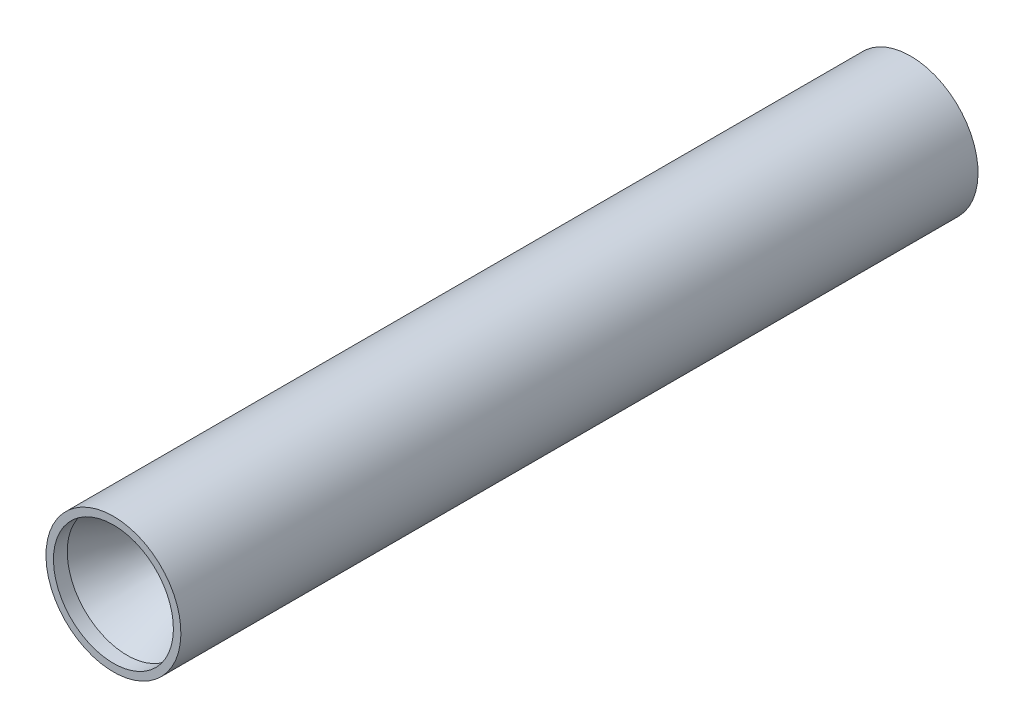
from build123d import *


with BuildPart() as part:
    # Sketch1 → Revolve1 (revolve)
    with BuildSketch(Plane(origin=(0, 0, 0), x_dir=(0, 0, -1), z_dir=(1, 0, 0))):
        Polygon((-289.5, 49), (289.5, 49), (289.5, 10), (279.5, 10), (279.5, 0), (264.5, 0), (264.5, 35.25), (-169.5, 35.25), (-169.5, 39), (-179.5, 39), (-204.5, 14), (-219.5, 15.576563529), (-279.5, 43.555023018), (-289.5, 43.555023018), align=None)
    revolve(axis=Axis((0, 0, -279.5), (0, 0, 1)))


solid = part.part
